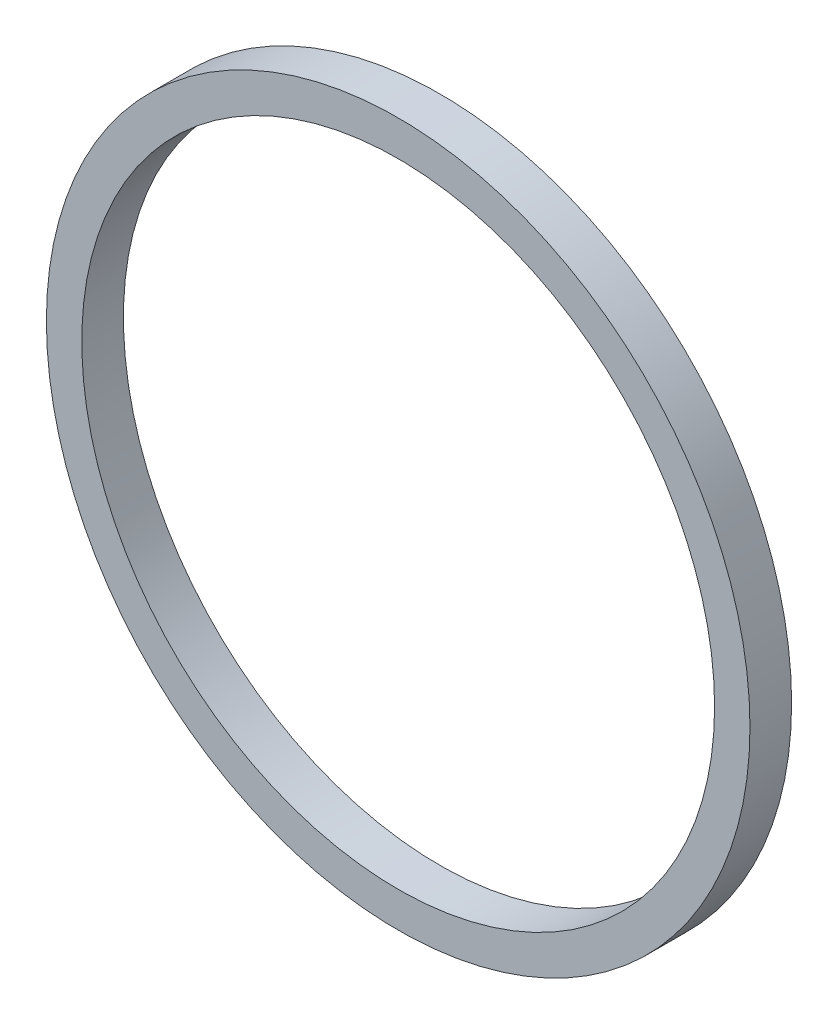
from build123d import *

# Parameters (mm, degrees)
SKETCH1_R      = 10.7315
SKETCH1_R_2    = 9.652
EXTRUDE1_DEPTH = 1.27


with BuildPart() as part:
    # Sketch1 → Extrude1 (new body)
    with BuildSketch(Plane.XY):
        Circle(SKETCH1_R)
        Circle(SKETCH1_R_2, mode=Mode.SUBTRACT)
    extrude(amount=EXTRUDE1_DEPTH)


solid = part.part
